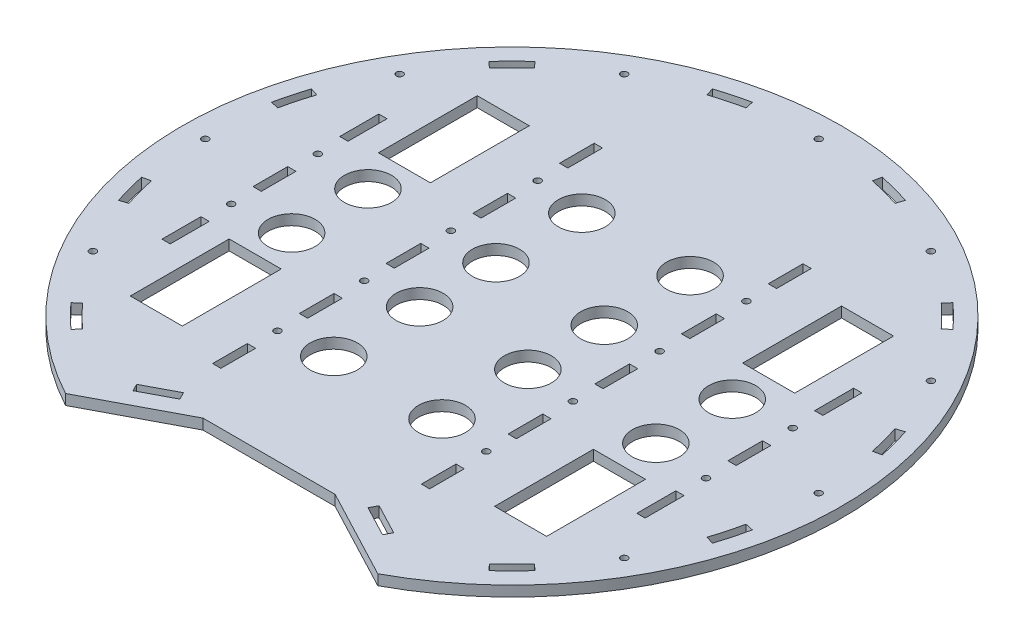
from build123d import *

# Parameters (mm, degrees)
SKETCH1_R           = 13.5729
SKETCH1_R_2         = 1.9558
SKETCH1_W           = 30
SKETCH1_H           = 57
SKETCH1_W_2         = 4.7625
SKETCH1_H_2         = 22.496894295
SKETCH1_H_3         = 20
BOSS_EXTRUDE1_DEPTH = 6


with BuildPart() as part:
    # Sketch1 → Boss-Extrude1 (new body)
    with BuildSketch(Plane(origin=(0, 0, 0), x_dir=(1, 0, 0), z_dir=(0, 1, 0))):
        with BuildLine():
            Line((-90, -167.332005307), (-38.1, -140))
            Line((-38.1, -140), (38.1, -140))
            Line((38.1, -140), (90, -167.332005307))
            ThreePointArc((90, -167.332005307), (0, 190), (-90, -167.332005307))
        make_face()
        with Locations(Location((-105, -22.009925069, 0), (0, 0, 270))):
            Circle(SKETCH1_R, mode=Mode.SUBTRACT)
        with Locations(Location((-105, 22.009925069, 0), (0, 0, 270))):
            Circle(SKETCH1_R, mode=Mode.SUBTRACT)
        with Locations(Location((105, 22.009925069, 0), (0, 0, 270))):
            Circle(SKETCH1_R, mode=Mode.SUBTRACT)
        with Locations(Location((105, -22.009925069, 0), (0, 0, 270))):
            Circle(SKETCH1_R, mode=Mode.SUBTRACT)
        with Locations(Location((-31.203328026, 22.009925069, 0), (0, 0, 270))):
            Circle(SKETCH1_R, mode=Mode.SUBTRACT)
        with Locations(Location((-31.203328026, 71.509925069, 0), (0, 0, 270))):
            Circle(SKETCH1_R, mode=Mode.SUBTRACT)
        with Locations(Location((-31.203328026, -22.009925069, 0), (0, 0, 270))):
            Circle(SKETCH1_R, mode=Mode.SUBTRACT)
        with Locations(Location((-31.203328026, -71.509925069, 0), (0, 0, 270))):
            Circle(SKETCH1_R, mode=Mode.SUBTRACT)
        with Locations(Location((31.203328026, -71.509925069, 0), (0, 0, 270))):
            Circle(SKETCH1_R, mode=Mode.SUBTRACT)
        with Locations(Location((31.203328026, -22.009925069, 0), (0, 0, 270))):
            Circle(SKETCH1_R, mode=Mode.SUBTRACT)
        with Locations(Location((31.203328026, 71.509925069, 0), (0, 0, 270))):
            Circle(SKETCH1_R, mode=Mode.SUBTRACT)
        with Locations(Location((31.203328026, 22.009925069, 0), (0, 0, 270))):
            Circle(SKETCH1_R, mode=Mode.SUBTRACT)
        with Locations(Location((-60.172078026, 75, 0), (0, 0, 270))):
            Circle(SKETCH1_R_2, mode=Mode.SUBTRACT)
        with Locations(Location((-60.172078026, 25, 0), (0, 0, 270))):
            Circle(SKETCH1_R_2, mode=Mode.SUBTRACT)
        with Locations(Location((-136.88125, 25, 0), (0, 0, 270))):
            Circle(SKETCH1_R_2, mode=Mode.SUBTRACT)
        with Locations(Location((-136.88125, -25, 0), (0, 0, 270))):
            Circle(SKETCH1_R_2, mode=Mode.SUBTRACT)
        with Locations(Location((-60.172078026, -25, 0), (0, 0, 270))):
            Circle(SKETCH1_R_2, mode=Mode.SUBTRACT)
        with Locations(Location((-60.172078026, -75, 0), (0, 0, 270))):
            Circle(SKETCH1_R_2, mode=Mode.SUBTRACT)
        with Locations(Location((0, 176.832186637, 0), (0, 0, 270))):
            Circle(SKETCH1_R_2, mode=Mode.SUBTRACT)
        with Locations(Location((88.416093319, 153.141165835, 0), (0, 0, 270))):
            Circle(SKETCH1_R_2, mode=Mode.SUBTRACT)
        with Locations(Location((153.141165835, 88.416093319, 0), (0, 0, 270))):
            Circle(SKETCH1_R_2, mode=Mode.SUBTRACT)
        with Locations(Location((176.832186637, 0, 0), (0, 0, 270))):
            Circle(SKETCH1_R_2, mode=Mode.SUBTRACT)
        with Locations(Location((153.141165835, -88.416093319, 0), (0, 0, 270))):
            Circle(SKETCH1_R_2, mode=Mode.SUBTRACT)
        with Locations(Location((-88.416093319, 153.141165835, 0), (0, 0, 270))):
            Circle(SKETCH1_R_2, mode=Mode.SUBTRACT)
        with Locations(Location((-153.141165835, 88.416093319, 0), (0, 0, 270))):
            Circle(SKETCH1_R_2, mode=Mode.SUBTRACT)
        with Locations(Location((-176.832186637, 0, 0), (0, 0, 270))):
            Circle(SKETCH1_R_2, mode=Mode.SUBTRACT)
        with Locations(Location((-153.141165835, -88.416093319, 0), (0, 0, 270))):
            Circle(SKETCH1_R_2, mode=Mode.SUBTRACT)
        with Locations(Location((60.172078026, 75, 0), (0, 0, 270))):
            Circle(SKETCH1_R_2, mode=Mode.SUBTRACT)
        with Locations(Location((60.172078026, 25, 0), (0, 0, 270))):
            Circle(SKETCH1_R_2, mode=Mode.SUBTRACT)
        with Locations(Location((60.172078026, -75, 0), (0, 0, 270))):
            Circle(SKETCH1_R_2, mode=Mode.SUBTRACT)
        with Locations(Location((60.172078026, -25, 0), (0, 0, 270))):
            Circle(SKETCH1_R_2, mode=Mode.SUBTRACT)
        with Locations(Location((136.88125, -25, 0), (0, 0, 270))):
            Circle(SKETCH1_R_2, mode=Mode.SUBTRACT)
        with Locations(Location((136.88125, 25, 0), (0, 0, 270))):
            Circle(SKETCH1_R_2, mode=Mode.SUBTRACT)
        with Locations((-105, -71.509925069)):
            Rectangle(SKETCH1_W, SKETCH1_H, mode=Mode.SUBTRACT)
        with Locations((-105, 71.509925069)):
            Rectangle(SKETCH1_W, SKETCH1_H, mode=Mode.SUBTRACT)
        with Locations((105, 71.509925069)):
            Rectangle(SKETCH1_W, SKETCH1_H, mode=Mode.SUBTRACT)
        with Locations((105, -71.509925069)):
            Rectangle(SKETCH1_W, SKETCH1_H, mode=Mode.SUBTRACT)
        with Locations((136.88125, -51.248447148)):
            Rectangle(SKETCH1_W_2, SKETCH1_H_2, mode=Mode.SUBTRACT)
        with Locations((-136.88125, 51.248447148)):
            Rectangle(SKETCH1_W_2, SKETCH1_H_2, mode=Mode.SUBTRACT)
        with Locations((-136.88125, 0)):
            Rectangle(SKETCH1_W_2, SKETCH1_H_3, mode=Mode.SUBTRACT)
        with Locations((-136.88125, -51.248447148)):
            Rectangle(SKETCH1_W_2, SKETCH1_H_2, mode=Mode.SUBTRACT)
        with Locations((136.88125, 0)):
            Rectangle(SKETCH1_W_2, SKETCH1_H_3, mode=Mode.SUBTRACT)
        with Locations((136.88125, 51.248447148)):
            Rectangle(SKETCH1_W_2, SKETCH1_H_2, mode=Mode.SUBTRACT)
        with BuildLine():
            Line((-54.152138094, 166.663143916), (-55.623058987, 171.190172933))
            ThreePointArc((-55.623058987, 171.190172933), (-46.587428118, 173.866648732), (-37.424104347, 176.066568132))
            Line((-37.424104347, 176.066568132), (-36.434444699, 171.410585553))
            ThreePointArc((-36.434444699, 171.410585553), (-45.355449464, 169.268841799), (-54.152138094, 166.663143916))
        make_face(mode=Mode.SUBTRACT)
        with BuildLine():
            Line((-120.443509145, 133.766068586), (-117.258447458, 130.228699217))
            ThreePointArc((-117.258447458, 130.228699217), (-123.913392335, 123.913392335), (-130.228699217, 117.258447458))
            Line((-130.228699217, 117.258447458), (-133.766068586, 120.443509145))
            ThreePointArc((-133.766068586, 120.443509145), (-127.279220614, 127.279220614), (-120.443509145, 133.766068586))
        make_face(mode=Mode.SUBTRACT)
        with BuildLine():
            Line((-171.190172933, 55.623058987), (-166.663143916, 54.152138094))
            ThreePointArc((-166.663143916, 54.152138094), (-169.268841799, 45.355449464), (-171.410585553, 36.434444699))
            Line((-171.410585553, 36.434444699), (-176.066568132, 37.424104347))
            ThreePointArc((-176.066568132, 37.424104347), (-173.866648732, 46.587428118), (-171.190172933, 55.623058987))
        make_face(mode=Mode.SUBTRACT)
        with BuildLine():
            Line((-176.066568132, -37.424104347), (-171.410585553, -36.434444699))
            ThreePointArc((-171.410585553, -36.434444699), (-169.268841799, -45.355449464), (-166.663143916, -54.152138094))
            Line((-166.663143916, -54.152138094), (-171.190172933, -55.623058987))
            ThreePointArc((-171.190172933, -55.623058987), (-173.866648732, -46.587428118), (-176.066568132, -37.424104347))
        make_face(mode=Mode.SUBTRACT)
        with BuildLine():
            Line((-133.766068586, -120.443509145), (-130.228699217, -117.258447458))
            ThreePointArc((-130.228699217, -117.258447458), (-123.913392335, -123.913392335), (-117.258447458, -130.228699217))
            Line((-117.258447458, -130.228699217), (-120.443509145, -133.766068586))
            ThreePointArc((-120.443509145, -133.766068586), (-127.279220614, -127.279220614), (-133.766068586, -120.443509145))
        make_face(mode=Mode.SUBTRACT)
        with Locations((60.172078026, 0)):
            Rectangle(SKETCH1_W_2, SKETCH1_H_3, mode=Mode.SUBTRACT)
        with BuildLine():
            Line((117.258447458, -130.228699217), (120.443509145, -133.766068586))
            ThreePointArc((120.443509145, -133.766068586), (127.279220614, -127.279220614), (133.766068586, -120.443509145))
            Line((133.766068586, -120.443509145), (130.228699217, -117.258447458))
            ThreePointArc((130.228699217, -117.258447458), (123.913392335, -123.913392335), (117.258447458, -130.228699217))
        make_face(mode=Mode.SUBTRACT)
        with BuildLine():
            Line((166.663143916, -54.152138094), (171.190172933, -55.623058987))
            ThreePointArc((171.190172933, -55.623058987), (173.866648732, -46.587428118), (176.066568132, -37.424104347))
            Line((176.066568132, -37.424104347), (171.410585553, -36.434444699))
            ThreePointArc((171.410585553, -36.434444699), (169.268841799, -45.355449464), (166.663143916, -54.152138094))
        make_face(mode=Mode.SUBTRACT)
        with BuildLine():
            Line((171.410585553, 36.434444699), (176.066568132, 37.424104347))
            ThreePointArc((176.066568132, 37.424104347), (173.866648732, 46.587428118), (171.190172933, 55.623058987))
            Line((171.190172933, 55.623058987), (166.663143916, 54.152138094))
            ThreePointArc((166.663143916, 54.152138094), (169.268841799, 45.355449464), (171.410585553, 36.434444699))
        make_face(mode=Mode.SUBTRACT)
        with BuildLine():
            Line((130.228699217, 117.258447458), (133.766068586, 120.443509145))
            ThreePointArc((133.766068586, 120.443509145), (127.279220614, 127.279220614), (120.443509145, 133.766068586))
            Line((120.443509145, 133.766068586), (117.258447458, 130.228699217))
            ThreePointArc((117.258447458, 130.228699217), (123.913392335, 123.913392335), (130.228699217, 117.258447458))
        make_face(mode=Mode.SUBTRACT)
        with BuildLine():
            Line((37.424104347, 176.066568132), (36.434444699, 171.410585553))
            ThreePointArc((36.434444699, 171.410585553), (45.355449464, 169.268841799), (54.152138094, 166.663143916))
            Line((54.152138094, 166.663143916), (55.623058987, 171.190172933))
            ThreePointArc((55.623058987, 171.190172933), (46.587428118, 173.866648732), (37.424104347, 176.066568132))
        make_face(mode=Mode.SUBTRACT)
        Polygon((-54.207873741, -137.180926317), (-56.425857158, -132.969258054), (-74.121942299, -142.288516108), (-71.903958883, -146.500184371), align=None, mode=Mode.SUBTRACT)
        Polygon((74.121942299, -142.288516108), (71.903958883, -146.500184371), (54.207873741, -137.180926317), (56.425857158, -132.969258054), align=None, mode=Mode.SUBTRACT)
        with Locations((-60.172078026, 50)):
            Rectangle(SKETCH1_W_2, SKETCH1_H_3, mode=Mode.SUBTRACT)
        with Locations((-60.172078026, 0)):
            Rectangle(SKETCH1_W_2, SKETCH1_H_3, mode=Mode.SUBTRACT)
        with Locations((-60.172078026, 100)):
            Rectangle(SKETCH1_W_2, SKETCH1_H_3, mode=Mode.SUBTRACT)
        with Locations((-60.172078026, -50)):
            Rectangle(SKETCH1_W_2, SKETCH1_H_3, mode=Mode.SUBTRACT)
        with Locations((-60.172078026, -100)):
            Rectangle(SKETCH1_W_2, SKETCH1_H_3, mode=Mode.SUBTRACT)
        with Locations((60.172078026, -50)):
            Rectangle(SKETCH1_W_2, SKETCH1_H_3, mode=Mode.SUBTRACT)
        with Locations((60.172078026, -100)):
            Rectangle(SKETCH1_W_2, SKETCH1_H_3, mode=Mode.SUBTRACT)
        with Locations((60.172078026, 100)):
            Rectangle(SKETCH1_W_2, SKETCH1_H_3, mode=Mode.SUBTRACT)
        with Locations((60.172078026, 50)):
            Rectangle(SKETCH1_W_2, SKETCH1_H_3, mode=Mode.SUBTRACT)
    extrude(amount=BOSS_EXTRUDE1_DEPTH)


solid = part.part
